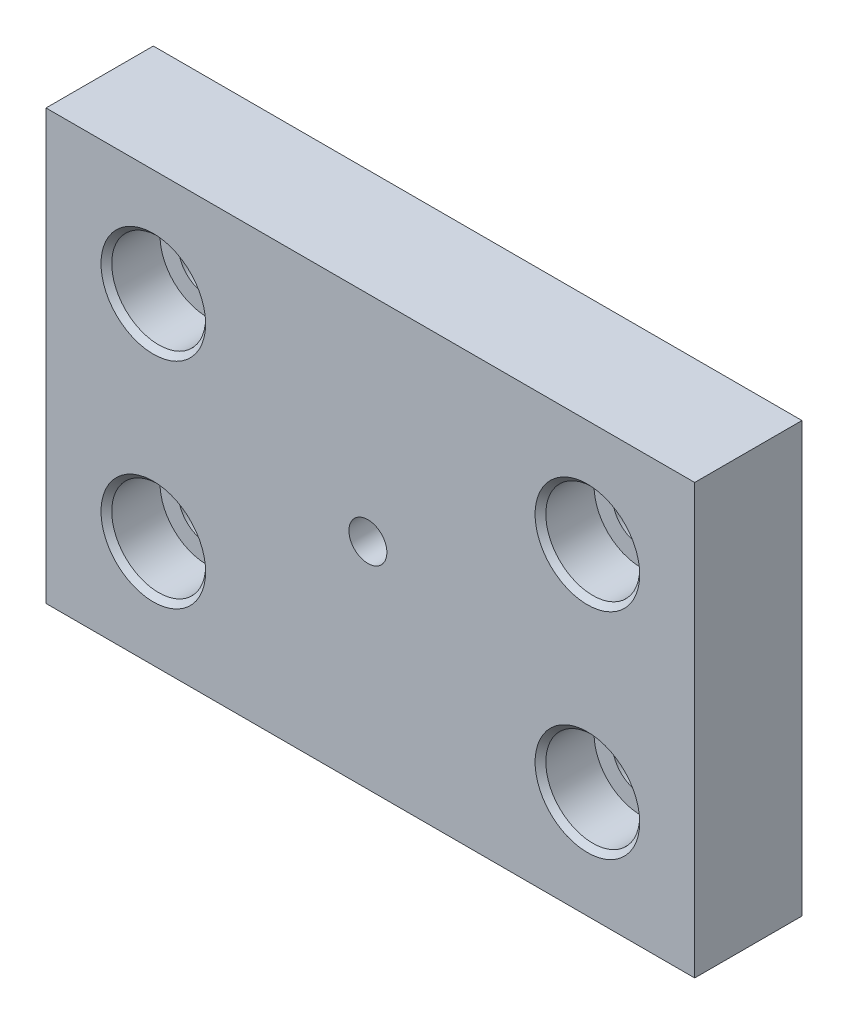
from build123d import *

# Parameters (mm, degrees)
SKETCH1_W                                     = 76.783167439
SKETCH1_H                                     = 50.8
BOSS_EXTRUDE1_DEPTH                           = 12.7
CBORE_FOR_1_4_SOCKET_HEAD_CAP_SCREW1_AT_COUNT = 2
CBORE_FOR_1_4_SOCKET_HEAD_CAP_SCREW1_AT_PITCH = 51.383167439
CBORE_FOR_1_4_SOCKET_HEAD_CAP_SCREW1_2_COUNT  = 2
CBORE_FOR_1_4_SOCKET_HEAD_CAP_SCREW1_2_PITCH  = 57.318320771
CBORE_FOR_1_4_SOCKET_HEAD_CAP_SCREW1_3_COUNT  = 2
CBORE_FOR_1_4_SOCKET_HEAD_CAP_SCREW1_3_PITCH  = 25.4


with BuildPart() as part:
    # Sketch1 → Boss-Extrude1 (new body)
    with BuildSketch(Plane.XY):
        with Locations((-18.828674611, 3.990405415)):
            Rectangle(SKETCH1_W, SKETCH1_H)
    extrude(amount=BOSS_EXTRUDE1_DEPTH)

    # Sketch3 → CBORE for 1_4 Socket Head Cap Screw1 (revolve, cut)
    with BuildSketch(Plane(origin=(-44.52025833, 16.690405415, 12.7), x_dir=(0, -1, 0), z_dir=(1, 0, 0))):
        Polygon((0, 0), (0, 12.7), (3.3782, 12.7), (3.3782, 6.35), (5.55625, 6.35), (5.55625, 0.635), (6.19125, 0), align=None)
    cbore_for_1_4_socket_head_cap_screw1 = revolve(axis=Axis((-44.52025833, 16.690405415, 19.05), (0, 0, -1)), mode=Mode.SUBTRACT)

    # CBORE for 1_4 Socket Head Cap Screw1 at: CBORE for 1_4 Socket Head Cap Screw1 ×2
    with Locations(*[(i * CBORE_FOR_1_4_SOCKET_HEAD_CAP_SCREW1_AT_PITCH, 0, 0) for i in range(1, CBORE_FOR_1_4_SOCKET_HEAD_CAP_SCREW1_AT_COUNT)]):
        add(cbore_for_1_4_socket_head_cap_screw1, mode=Mode.SUBTRACT)

    # CBORE for 1_4 Socket Head Cap Screw1 2: CBORE for 1_4 Socket Head Cap Screw1 ×2
    with Locations(*[Vector(0.8964527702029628, -0.4431392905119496, 0) * (i * CBORE_FOR_1_4_SOCKET_HEAD_CAP_SCREW1_2_PITCH) for i in range(1, CBORE_FOR_1_4_SOCKET_HEAD_CAP_SCREW1_2_COUNT)]):
        add(cbore_for_1_4_socket_head_cap_screw1, mode=Mode.SUBTRACT)

    # CBORE for 1_4 Socket Head Cap Screw1 3: CBORE for 1_4 Socket Head Cap Screw1 ×2
    with Locations(*[(0, -i * CBORE_FOR_1_4_SOCKET_HEAD_CAP_SCREW1_3_PITCH, 0) for i in range(1, CBORE_FOR_1_4_SOCKET_HEAD_CAP_SCREW1_3_COUNT)]):
        add(cbore_for_1_4_socket_head_cap_screw1, mode=Mode.SUBTRACT)

    # Sketch5 → CBORE for _8 Socket Head Cap Screw1 (revolve, cut)
    with BuildSketch(Plane(origin=(-19.12025833, 3.990405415, 0), x_dir=(0, 1, 0), z_dir=(1, 0, 0))):
        Polygon((0, 0), (0, 12.7), (2.2479, 12.7), (2.2479, 4.1656), (3.96875, 4.1656), (3.96875, 0.635), (4.60375, 0), align=None)
    revolve(axis=Axis((-19.12025833, 3.990405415, -6.35), (0, 0, 1)), mode=Mode.SUBTRACT)


solid = part.part
